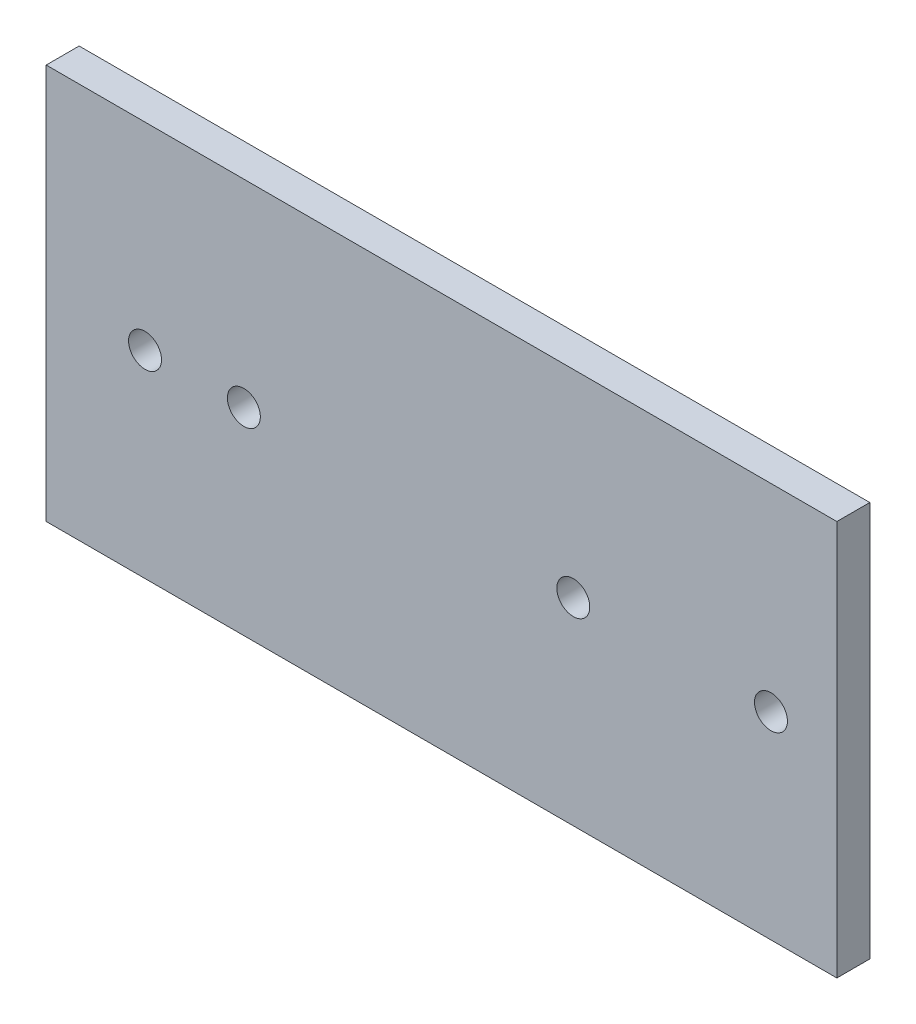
from build123d import *

# Parameters (mm, degrees)
SKETCH1_W             = 120
SKETCH1_H             = 60
BOSS_EXTRUDE1_DEPTH   = 5
M6X1_0_TAPPED_HOLE1_D = 5


with BuildPart() as part:
    # Sketch1 → Boss-Extrude1 (new body)
    with BuildSketch(Plane.XY):
        Rectangle(SKETCH1_W, SKETCH1_H)
    extrude(amount=BOSS_EXTRUDE1_DEPTH)

    # M6x1.0 Tapped Hole1 (through all)
    with Locations(Plane(origin=(0, 0, 0), x_dir=(-1, 0, 0), z_dir=(0, 0, -1))):
        with Locations((-50, 0), (-20, 0), (30, 0), (45, 0)):
            Hole(M6X1_0_TAPPED_HOLE1_D / 2)


solid = part.part
